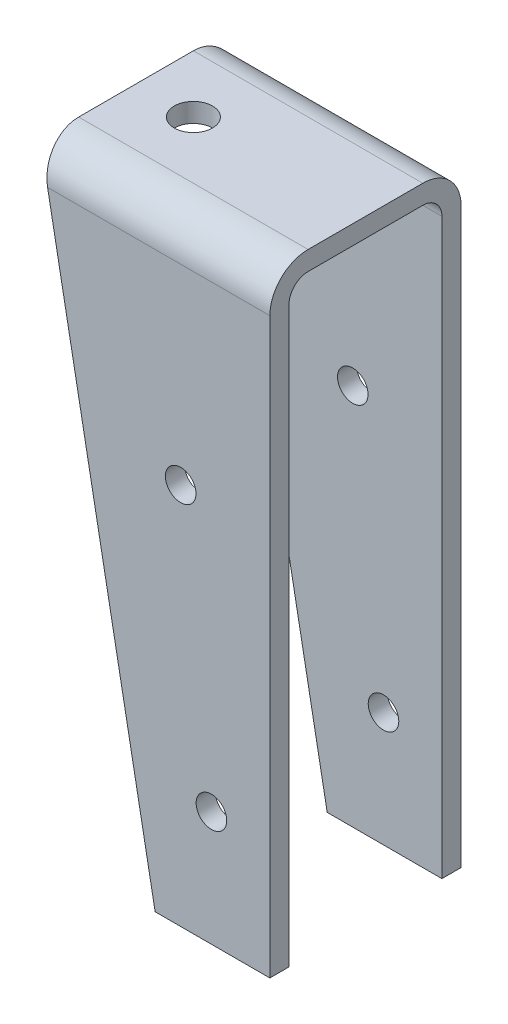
ISO-10303-21;
HEADER;
FILE_DESCRIPTION(('STEP AP214'),'2;1');
FILE_NAME('part.step','',(''),(''),'','','');
FILE_SCHEMA(('AUTOMOTIVE_DESIGN { 1 0 10303 214 1 1 1 1 }'));
ENDSEC;
DATA;
#1=APPLICATION_CONTEXT('core data for automotive mechanical design processes');
#2=APPLICATION_PROTOCOL_DEFINITION('international standard','automotive_design',2000,#1);
#3=PRODUCT_CONTEXT('',#1,'mechanical');
#4=PRODUCT('Part','Part','',(#3));
#5=PRODUCT_RELATED_PRODUCT_CATEGORY('part','',(#4));
#6=PRODUCT_DEFINITION_FORMATION('','',#4);
#7=PRODUCT_DEFINITION_CONTEXT('part definition',#1,'design');
#8=PRODUCT_DEFINITION('design','',#6,#7);
#9=PRODUCT_DEFINITION_SHAPE('','',#8);
#10=(LENGTH_UNIT() NAMED_UNIT(*) SI_UNIT(.MILLI.,.METRE.));
#11=(NAMED_UNIT(*) PLANE_ANGLE_UNIT() SI_UNIT($,.RADIAN.));
#12=(NAMED_UNIT(*) SI_UNIT($,.STERADIAN.) SOLID_ANGLE_UNIT());
#13=UNCERTAINTY_MEASURE_WITH_UNIT(LENGTH_MEASURE(1.E-05),#10,'distance_accuracy_value','');
#14=(GEOMETRIC_REPRESENTATION_CONTEXT(3) GLOBAL_UNCERTAINTY_ASSIGNED_CONTEXT((#13)) GLOBAL_UNIT_ASSIGNED_CONTEXT((#10,
#11,#12)) REPRESENTATION_CONTEXT('',''));
#15=CARTESIAN_POINT('',(0.,0.,0.));
#16=DIRECTION('',(0.,0.,1.));
#17=DIRECTION('',(1.,0.,0.));
#18=AXIS2_PLACEMENT_3D('',#15,#16,#17);
#19=CARTESIAN_POINT('',(-30.,0.,50.));
#20=DIRECTION('',(0.,1.,0.));
#21=DIRECTION('',(0.,0.,1.));
#22=AXIS2_PLACEMENT_3D('',#19,#20,#21);
#23=PLANE('',#22);
#24=DIRECTION('',(0.,0.,-1.));
#25=VECTOR('',#24,1.);
#26=CARTESIAN_POINT('',(0.,0.,50.));
#27=LINE('',#26,#25);
#28=CARTESIAN_POINT('',(0.,0.,5.));
#29=VERTEX_POINT('',#28);
#30=CARTESIAN_POINT('',(0.,0.,0.));
#31=VERTEX_POINT('',#30);
#32=EDGE_CURVE('E144',#29,#31,#27,.T.);
#33=ORIENTED_EDGE('',*,*,#32,.F.);
#34=DIRECTION('',(1.,0.,0.));
#35=VECTOR('',#34,1.);
#36=CARTESIAN_POINT('',(-60.,0.,5.));
#37=LINE('',#36,#35);
#38=CARTESIAN_POINT('',(-30.,0.,5.));
#39=VERTEX_POINT('',#38);
#40=EDGE_CURVE('E138',#39,#29,#37,.T.);
#41=ORIENTED_EDGE('',*,*,#40,.F.);
#42=DIRECTION('',(0.,0.,-1.));
#43=VECTOR('',#42,1.);
#44=CARTESIAN_POINT('',(-30.,0.,50.));
#45=LINE('',#44,#43);
#46=CARTESIAN_POINT('',(-30.,0.,0.));
#47=VERTEX_POINT('',#46);
#48=EDGE_CURVE('E220',#39,#47,#45,.T.);
#49=ORIENTED_EDGE('',*,*,#48,.T.);
#50=DIRECTION('',(1.,0.,0.));
#51=VECTOR('',#50,1.);
#52=CARTESIAN_POINT('',(-30.,0.,0.));
#53=LINE('',#52,#51);
#54=EDGE_CURVE('E207',#47,#31,#53,.T.);
#55=ORIENTED_EDGE('',*,*,#54,.T.);
#56=EDGE_LOOP('',(#33,#41,#49,#55));
#57=FACE_BOUND('',#56,.T.);
#58=ADVANCED_FACE('F26',(#57),#23,.F.);
#59=CARTESIAN_POINT('',(-30.,0.,50.));
#60=VERTEX_POINT('',#59);
#61=CARTESIAN_POINT('',(-30.,0.,45.));
#62=VERTEX_POINT('',#61);
#63=EDGE_CURVE('E137',#60,#62,#45,.T.);
#64=ORIENTED_EDGE('',*,*,#63,.T.);
#65=DIRECTION('',(1.,0.,0.));
#66=VECTOR('',#65,1.);
#67=CARTESIAN_POINT('',(-60.,0.,45.));
#68=LINE('',#67,#66);
#69=CARTESIAN_POINT('',(0.,0.,45.));
#70=VERTEX_POINT('',#69);
#71=EDGE_CURVE('E125',#62,#70,#68,.T.);
#72=ORIENTED_EDGE('',*,*,#71,.T.);
#73=CARTESIAN_POINT('',(0.,0.,50.));
#74=VERTEX_POINT('',#73);
#75=EDGE_CURVE('E135',#74,#70,#27,.T.);
#76=ORIENTED_EDGE('',*,*,#75,.F.);
#77=DIRECTION('',(1.,0.,0.));
#78=VECTOR('',#77,1.);
#79=CARTESIAN_POINT('',(-30.,0.,50.));
#80=LINE('',#79,#78);
#81=EDGE_CURVE('E215',#60,#74,#80,.T.);
#82=ORIENTED_EDGE('',*,*,#81,.F.);
#83=EDGE_LOOP('',(#64,#72,#76,#82));
#84=FACE_BOUND('',#83,.T.);
#85=ADVANCED_FACE('F28',(#84),#23,.F.);
#86=CARTESIAN_POINT('',(0.,0.,50.));
#87=DIRECTION('',(-1.,0.,0.));
#88=DIRECTION('',(0.,0.,1.));
#89=AXIS2_PLACEMENT_3D('',#86,#87,#88);
#90=PLANE('',#89);
#91=DIRECTION('',(0.,1.,0.));
#92=VECTOR('',#91,1.);
#93=CARTESIAN_POINT('',(0.,0.,0.));
#94=LINE('',#93,#92);
#95=CARTESIAN_POINT('',(0.,150.,0.));
#96=VERTEX_POINT('',#95);
#97=EDGE_CURVE('E211',#31,#96,#94,.T.);
#98=ORIENTED_EDGE('',*,*,#97,.T.);
#99=CARTESIAN_POINT('',(0.,150.,10.));
#100=DIRECTION('',(-1.,0.,0.));
#101=DIRECTION('',(0.,0.,1.));
#102=AXIS2_PLACEMENT_3D('',#99,#100,#101);
#103=CIRCLE('',#102,10.);
#104=CARTESIAN_POINT('',(0.,160.,10.));
#105=VERTEX_POINT('',#104);
#106=EDGE_CURVE('E35',#96,#105,#103,.F.);
#107=ORIENTED_EDGE('',*,*,#106,.T.);
#108=DIRECTION('',(0.,0.,-1.));
#109=VECTOR('',#108,1.);
#110=CARTESIAN_POINT('',(0.,160.,50.));
#111=LINE('',#110,#109);
#112=CARTESIAN_POINT('',(0.,160.,40.));
#113=VERTEX_POINT('',#112);
#114=EDGE_CURVE('E149',#113,#105,#111,.T.);
#115=ORIENTED_EDGE('',*,*,#114,.F.);
#116=CARTESIAN_POINT('',(0.,150.,40.));
#117=DIRECTION('',(-1.,0.,0.));
#118=DIRECTION('',(0.,0.,1.));
#119=AXIS2_PLACEMENT_3D('',#116,#117,#118);
#120=CIRCLE('',#119,10.);
#121=CARTESIAN_POINT('',(0.,150.,50.));
#122=VERTEX_POINT('',#121);
#123=EDGE_CURVE('E43',#113,#122,#120,.F.);
#124=ORIENTED_EDGE('',*,*,#123,.T.);
#125=DIRECTION('',(0.,1.,0.));
#126=VECTOR('',#125,1.);
#127=CARTESIAN_POINT('',(0.,0.,50.));
#128=LINE('',#127,#126);
#129=EDGE_CURVE('E141',#74,#122,#128,.T.);
#130=ORIENTED_EDGE('',*,*,#129,.F.);
#131=ORIENTED_EDGE('',*,*,#75,.T.);
#132=DIRECTION('',(0.,-1.,0.));
#133=VECTOR('',#132,1.);
#134=CARTESIAN_POINT('',(0.,0.,45.));
#135=LINE('',#134,#133);
#136=CARTESIAN_POINT('',(0.,150.,45.));
#137=VERTEX_POINT('',#136);
#138=EDGE_CURVE('E121',#137,#70,#135,.T.);
#139=ORIENTED_EDGE('',*,*,#138,.F.);
#140=CARTESIAN_POINT('',(0.,150.,40.));
#141=DIRECTION('',(-1.,0.,0.));
#142=DIRECTION('',(0.,0.,1.));
#143=AXIS2_PLACEMENT_3D('',#140,#141,#142);
#144=CIRCLE('',#143,5.);
#145=CARTESIAN_POINT('',(0.,155.,40.));
#146=VERTEX_POINT('',#145);
#147=EDGE_CURVE('E169',#137,#146,#144,.T.);
#148=ORIENTED_EDGE('',*,*,#147,.T.);
#149=DIRECTION('',(0.,0.,1.));
#150=VECTOR('',#149,1.);
#151=CARTESIAN_POINT('',(0.,155.,5.));
#152=LINE('',#151,#150);
#153=CARTESIAN_POINT('',(0.,155.,10.));
#154=VERTEX_POINT('',#153);
#155=EDGE_CURVE('E130',#154,#146,#152,.T.);
#156=ORIENTED_EDGE('',*,*,#155,.F.);
#157=CARTESIAN_POINT('',(0.,150.,10.));
#158=DIRECTION('',(-1.,0.,0.));
#159=DIRECTION('',(0.,0.,1.));
#160=AXIS2_PLACEMENT_3D('',#157,#158,#159);
#161=CIRCLE('',#160,5.);
#162=CARTESIAN_POINT('',(0.,150.,5.));
#163=VERTEX_POINT('',#162);
#164=EDGE_CURVE('E165',#154,#163,#161,.T.);
#165=ORIENTED_EDGE('',*,*,#164,.T.);
#166=DIRECTION('',(0.,1.,0.));
#167=VECTOR('',#166,1.);
#168=CARTESIAN_POINT('',(0.,0.,5.));
#169=LINE('',#168,#167);
#170=EDGE_CURVE('E191',#29,#163,#169,.T.);
#171=ORIENTED_EDGE('',*,*,#170,.F.);
#172=ORIENTED_EDGE('',*,*,#32,.T.);
#173=EDGE_LOOP('',(#98,#107,#115,#124,#130,#131,#139,#148,#156,#165,#171,#172));
#174=FACE_BOUND('',#173,.T.);
#175=ADVANCED_FACE('F140',(#174),#90,.F.);
#176=CARTESIAN_POINT('',(0.,160.,50.));
#177=DIRECTION('',(0.,-1.,0.));
#178=DIRECTION('',(0.,0.,-1.));
#179=AXIS2_PLACEMENT_3D('',#176,#177,#178);
#180=PLANE('',#179);
#181=CARTESIAN_POINT('',(-45.,160.,25.));
#182=DIRECTION('',(0.,1.,0.));
#183=DIRECTION('',(0.,0.,1.));
#184=AXIS2_PLACEMENT_3D('',#181,#182,#183);
#185=CIRCLE('',#184,4.99999999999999);
#186=CARTESIAN_POINT('',(-45.,160.,30.));
#187=VERTEX_POINT('',#186);
#188=EDGE_CURVE('E390',#187,#187,#185,.T.);
#189=ORIENTED_EDGE('',*,*,#188,.F.);
#190=EDGE_LOOP('',(#189));
#191=FACE_BOUND('',#190,.T.);
#192=ORIENTED_EDGE('',*,*,#114,.T.);
#193=DIRECTION('',(-1.,0.,0.));
#194=VECTOR('',#193,1.);
#195=CARTESIAN_POINT('',(0.,160.,10.));
#196=LINE('',#195,#194);
#197=CARTESIAN_POINT('',(-60.,160.,10.));
#198=VERTEX_POINT('',#197);
#199=EDGE_CURVE('E175',#105,#198,#196,.T.);
#200=ORIENTED_EDGE('',*,*,#199,.T.);
#201=DIRECTION('',(0.,0.,-1.));
#202=VECTOR('',#201,1.);
#203=CARTESIAN_POINT('',(-60.,160.,50.));
#204=LINE('',#203,#202);
#205=CARTESIAN_POINT('',(-60.,160.,40.));
#206=VERTEX_POINT('',#205);
#207=EDGE_CURVE('E221',#206,#198,#204,.T.);
#208=ORIENTED_EDGE('',*,*,#207,.F.);
#209=DIRECTION('',(-1.,0.,0.));
#210=VECTOR('',#209,1.);
#211=CARTESIAN_POINT('',(0.,160.,40.));
#212=LINE('',#211,#210);
#213=EDGE_CURVE('E173',#206,#113,#212,.F.);
#214=ORIENTED_EDGE('',*,*,#213,.T.);
#215=EDGE_LOOP('',(#192,#200,#208,#214));
#216=FACE_BOUND('',#215,.T.);
#217=ADVANCED_FACE('F228',(#191,#216),#180,.F.);
#218=CARTESIAN_POINT('',(-60.,160.,50.));
#219=DIRECTION('',(0.982872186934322,0.184288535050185,0.));
#220=DIRECTION('',(-0.184288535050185,0.982872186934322,0.));
#221=AXIS2_PLACEMENT_3D('',#218,#219,#220);
#222=PLANE('',#221);
#223=ORIENTED_EDGE('',*,*,#207,.T.);
#224=CARTESIAN_POINT('',(-58.125,150.,10.));
#225=DIRECTION('',(0.982872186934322,0.184288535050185,0.));
#226=DIRECTION('',(-0.184288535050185,0.982872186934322,0.));
#227=AXIS2_PLACEMENT_3D('',#224,#225,#226);
#228=ELLIPSE('',#227,10.1742628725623,10.);
#229=CARTESIAN_POINT('',(-58.125,150.,0.));
#230=VERTEX_POINT('',#229);
#231=EDGE_CURVE('E180',#198,#230,#228,.F.);
#232=ORIENTED_EDGE('',*,*,#231,.T.);
#233=DIRECTION('',(0.184288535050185,-0.982872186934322,0.));
#234=VECTOR('',#233,1.);
#235=CARTESIAN_POINT('',(-60.,160.,0.));
#236=LINE('',#235,#234);
#237=EDGE_CURVE('E213',#230,#47,#236,.T.);
#238=ORIENTED_EDGE('',*,*,#237,.T.);
#239=ORIENTED_EDGE('',*,*,#48,.F.);
#240=DIRECTION('',(-0.184288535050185,0.982872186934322,0.));
#241=VECTOR('',#240,1.);
#242=CARTESIAN_POINT('',(-60.,160.,5.));
#243=LINE('',#242,#241);
#244=CARTESIAN_POINT('',(-58.125,150.,5.));
#245=VERTEX_POINT('',#244);
#246=EDGE_CURVE('E154',#39,#245,#243,.T.);
#247=ORIENTED_EDGE('',*,*,#246,.T.);
#248=CARTESIAN_POINT('',(-58.125,150.,10.));
#249=DIRECTION('',(0.982872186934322,0.184288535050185,0.));
#250=DIRECTION('',(-0.184288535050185,0.982872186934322,0.));
#251=AXIS2_PLACEMENT_3D('',#248,#249,#250);
#252=ELLIPSE('',#251,5.08713143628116,5.);
#253=CARTESIAN_POINT('',(-59.0625,155.,10.));
#254=VERTEX_POINT('',#253);
#255=EDGE_CURVE('E167',#245,#254,#252,.T.);
#256=ORIENTED_EDGE('',*,*,#255,.T.);
#257=DIRECTION('',(0.,0.,1.));
#258=VECTOR('',#257,1.);
#259=CARTESIAN_POINT('',(-59.0625,155.,50.));
#260=LINE('',#259,#258);
#261=CARTESIAN_POINT('',(-59.0625,155.,40.));
#262=VERTEX_POINT('',#261);
#263=EDGE_CURVE('E143',#254,#262,#260,.T.);
#264=ORIENTED_EDGE('',*,*,#263,.T.);
#265=CARTESIAN_POINT('',(-58.125,150.,40.));
#266=DIRECTION('',(0.982872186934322,0.184288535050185,0.));
#267=DIRECTION('',(-0.184288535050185,0.982872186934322,0.));
#268=AXIS2_PLACEMENT_3D('',#265,#266,#267);
#269=ELLIPSE('',#268,5.08713143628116,5.);
#270=CARTESIAN_POINT('',(-58.125,150.,45.));
#271=VERTEX_POINT('',#270);
#272=EDGE_CURVE('E171',#262,#271,#269,.T.);
#273=ORIENTED_EDGE('',*,*,#272,.T.);
#274=DIRECTION('',(0.184288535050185,-0.982872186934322,0.));
#275=VECTOR('',#274,1.);
#276=CARTESIAN_POINT('',(-60.,160.,45.));
#277=LINE('',#276,#275);
#278=EDGE_CURVE('E147',#271,#62,#277,.T.);
#279=ORIENTED_EDGE('',*,*,#278,.T.);
#280=ORIENTED_EDGE('',*,*,#63,.F.);
#281=DIRECTION('',(0.184288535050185,-0.982872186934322,0.));
#282=VECTOR('',#281,1.);
#283=CARTESIAN_POINT('',(-60.,160.,50.));
#284=LINE('',#283,#282);
#285=CARTESIAN_POINT('',(-58.125,150.,50.));
#286=VERTEX_POINT('',#285);
#287=EDGE_CURVE('E218',#286,#60,#284,.T.);
#288=ORIENTED_EDGE('',*,*,#287,.F.);
#289=CARTESIAN_POINT('',(-58.125,150.,40.));
#290=DIRECTION('',(0.982872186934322,0.184288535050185,0.));
#291=DIRECTION('',(0.184288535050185,-0.982872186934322,0.));
#292=AXIS2_PLACEMENT_3D('',#289,#290,#291);
#293=ELLIPSE('',#292,10.1742628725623,10.);
#294=EDGE_CURVE('E178',#286,#206,#293,.F.);
#295=ORIENTED_EDGE('',*,*,#294,.T.);
#296=EDGE_LOOP('',(#223,#232,#238,#239,#247,#256,#264,#273,#279,#280,#288,#295));
#297=FACE_BOUND('',#296,.T.);
#298=ADVANCED_FACE('F233',(#297),#222,.F.);
#299=CARTESIAN_POINT('',(0.,0.,50.));
#300=DIRECTION('',(0.,0.,1.));
#301=DIRECTION('',(1.,0.,0.));
#302=AXIS2_PLACEMENT_3D('',#299,#300,#301);
#303=PLANE('',#302);
#304=CARTESIAN_POINT('',(-15.2764742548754,30.,50.));
#305=DIRECTION('',(0.,0.,1.));
#306=DIRECTION('',(1.,0.,0.));
#307=AXIS2_PLACEMENT_3D('',#304,#305,#306);
#308=CIRCLE('',#307,4.);
#309=CARTESIAN_POINT('',(-11.2764742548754,30.,50.));
#310=VERTEX_POINT('',#309);
#311=EDGE_CURVE('E394',#310,#310,#308,.T.);
#312=ORIENTED_EDGE('',*,*,#311,.F.);
#313=EDGE_LOOP('',(#312));
#314=FACE_BOUND('',#313,.T.);
#315=CARTESIAN_POINT('',(-23.3143428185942,100.,50.));
#316=DIRECTION('',(0.,0.,1.));
#317=DIRECTION('',(1.,0.,0.));
#318=AXIS2_PLACEMENT_3D('',#315,#316,#317);
#319=CIRCLE('',#318,4.00000000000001);
#320=CARTESIAN_POINT('',(-19.3143428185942,100.,50.));
#321=VERTEX_POINT('',#320);
#322=EDGE_CURVE('E194',#321,#321,#319,.T.);
#323=ORIENTED_EDGE('',*,*,#322,.F.);
#324=EDGE_LOOP('',(#323));
#325=FACE_BOUND('',#324,.T.);
#326=ORIENTED_EDGE('',*,*,#129,.T.);
#327=DIRECTION('',(-1.,0.,0.));
#328=VECTOR('',#327,1.);
#329=CARTESIAN_POINT('',(-60.,150.,50.));
#330=LINE('',#329,#328);
#331=EDGE_CURVE('E11',#122,#286,#330,.T.);
#332=ORIENTED_EDGE('',*,*,#331,.T.);
#333=ORIENTED_EDGE('',*,*,#287,.T.);
#334=ORIENTED_EDGE('',*,*,#81,.T.);
#335=EDGE_LOOP('',(#326,#332,#333,#334));
#336=FACE_BOUND('',#335,.T.);
#337=ADVANCED_FACE('F258',(#314,#325,#336),#303,.T.);
#338=CARTESIAN_POINT('',(0.,0.,0.));
#339=DIRECTION('',(0.,0.,1.));
#340=DIRECTION('',(1.,0.,0.));
#341=AXIS2_PLACEMENT_3D('',#338,#339,#340);
#342=PLANE('',#341);
#343=CARTESIAN_POINT('',(-15.2764742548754,30.,0.));
#344=DIRECTION('',(0.,0.,1.));
#345=DIRECTION('',(1.,0.,0.));
#346=AXIS2_PLACEMENT_3D('',#343,#344,#345);
#347=CIRCLE('',#346,4.);
#348=CARTESIAN_POINT('',(-11.2764742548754,30.,0.));
#349=VERTEX_POINT('',#348);
#350=EDGE_CURVE('E397',#349,#349,#347,.T.);
#351=ORIENTED_EDGE('',*,*,#350,.T.);
#352=EDGE_LOOP('',(#351));
#353=FACE_BOUND('',#352,.T.);
#354=CARTESIAN_POINT('',(-23.3143428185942,100.,0.));
#355=DIRECTION('',(0.,0.,1.));
#356=DIRECTION('',(1.,0.,0.));
#357=AXIS2_PLACEMENT_3D('',#354,#355,#356);
#358=CIRCLE('',#357,4.00000000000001);
#359=CARTESIAN_POINT('',(-19.3143428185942,100.,0.));
#360=VERTEX_POINT('',#359);
#361=EDGE_CURVE('E187',#360,#360,#358,.T.);
#362=ORIENTED_EDGE('',*,*,#361,.T.);
#363=EDGE_LOOP('',(#362));
#364=FACE_BOUND('',#363,.T.);
#365=ORIENTED_EDGE('',*,*,#237,.F.);
#366=DIRECTION('',(-1.,0.,0.));
#367=VECTOR('',#366,1.);
#368=CARTESIAN_POINT('',(0.,150.,0.));
#369=LINE('',#368,#367);
#370=EDGE_CURVE('E51',#230,#96,#369,.F.);
#371=ORIENTED_EDGE('',*,*,#370,.T.);
#372=ORIENTED_EDGE('',*,*,#97,.F.);
#373=ORIENTED_EDGE('',*,*,#54,.F.);
#374=EDGE_LOOP('',(#365,#371,#372,#373));
#375=FACE_BOUND('',#374,.T.);
#376=ADVANCED_FACE('F237',(#353,#364,#375),#342,.F.);
#377=CARTESIAN_POINT('',(-60.,0.,5.));
#378=DIRECTION('',(0.,0.,-1.));
#379=DIRECTION('',(0.,1.,0.));
#380=AXIS2_PLACEMENT_3D('',#377,#378,#379);
#381=PLANE('',#380);
#382=CARTESIAN_POINT('',(-15.2764742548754,30.,5.));
#383=DIRECTION('',(0.,0.,-1.));
#384=DIRECTION('',(0.,1.,0.));
#385=AXIS2_PLACEMENT_3D('',#382,#383,#384);
#386=CIRCLE('',#385,4.);
#387=CARTESIAN_POINT('',(-15.2764742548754,34.,5.));
#388=VERTEX_POINT('',#387);
#389=EDGE_CURVE('E199',#388,#388,#386,.T.);
#390=ORIENTED_EDGE('',*,*,#389,.T.);
#391=EDGE_LOOP('',(#390));
#392=FACE_BOUND('',#391,.T.);
#393=CARTESIAN_POINT('',(-23.3143428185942,100.,5.));
#394=DIRECTION('',(0.,0.,-1.));
#395=DIRECTION('',(0.,1.,0.));
#396=AXIS2_PLACEMENT_3D('',#393,#394,#395);
#397=CIRCLE('',#396,4.00000000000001);
#398=CARTESIAN_POINT('',(-23.3143428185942,104.,5.));
#399=VERTEX_POINT('',#398);
#400=EDGE_CURVE('E186',#399,#399,#397,.T.);
#401=ORIENTED_EDGE('',*,*,#400,.T.);
#402=EDGE_LOOP('',(#401));
#403=FACE_BOUND('',#402,.T.);
#404=ORIENTED_EDGE('',*,*,#170,.T.);
#405=DIRECTION('',(1.,0.,0.));
#406=VECTOR('',#405,1.);
#407=CARTESIAN_POINT('',(-59.0625,150.,5.));
#408=LINE('',#407,#406);
#409=EDGE_CURVE('E162',#163,#245,#408,.F.);
#410=ORIENTED_EDGE('',*,*,#409,.T.);
#411=ORIENTED_EDGE('',*,*,#246,.F.);
#412=ORIENTED_EDGE('',*,*,#40,.T.);
#413=EDGE_LOOP('',(#404,#410,#411,#412));
#414=FACE_BOUND('',#413,.T.);
#415=ADVANCED_FACE('F295',(#392,#403,#414),#381,.F.);
#416=CARTESIAN_POINT('',(-60.,0.,45.));
#417=DIRECTION('',(0.,0.,1.));
#418=DIRECTION('',(1.,0.,0.));
#419=AXIS2_PLACEMENT_3D('',#416,#417,#418);
#420=PLANE('',#419);
#421=CARTESIAN_POINT('',(-15.2764742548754,30.,45.));
#422=DIRECTION('',(0.,0.,1.));
#423=DIRECTION('',(1.,0.,0.));
#424=AXIS2_PLACEMENT_3D('',#421,#422,#423);
#425=CIRCLE('',#424,4.);
#426=CARTESIAN_POINT('',(-11.2764742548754,30.,45.));
#427=VERTEX_POINT('',#426);
#428=EDGE_CURVE('E30',#427,#427,#425,.T.);
#429=ORIENTED_EDGE('',*,*,#428,.T.);
#430=EDGE_LOOP('',(#429));
#431=FACE_BOUND('',#430,.T.);
#432=CARTESIAN_POINT('',(-23.3143428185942,100.,45.));
#433=DIRECTION('',(0.,0.,1.));
#434=DIRECTION('',(1.,0.,0.));
#435=AXIS2_PLACEMENT_3D('',#432,#433,#434);
#436=CIRCLE('',#435,4.00000000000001);
#437=CARTESIAN_POINT('',(-19.3143428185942,100.,45.));
#438=VERTEX_POINT('',#437);
#439=EDGE_CURVE('E184',#438,#438,#436,.T.);
#440=ORIENTED_EDGE('',*,*,#439,.T.);
#441=EDGE_LOOP('',(#440));
#442=FACE_BOUND('',#441,.T.);
#443=ORIENTED_EDGE('',*,*,#278,.F.);
#444=DIRECTION('',(1.,0.,0.));
#445=VECTOR('',#444,1.);
#446=CARTESIAN_POINT('',(0.,150.,45.));
#447=LINE('',#446,#445);
#448=EDGE_CURVE('E128',#271,#137,#447,.T.);
#449=ORIENTED_EDGE('',*,*,#448,.T.);
#450=ORIENTED_EDGE('',*,*,#138,.T.);
#451=ORIENTED_EDGE('',*,*,#71,.F.);
#452=EDGE_LOOP('',(#443,#449,#450,#451));
#453=FACE_BOUND('',#452,.T.);
#454=ADVANCED_FACE('F124',(#431,#442,#453),#420,.F.);
#455=CARTESIAN_POINT('',(-60.,155.,5.));
#456=DIRECTION('',(0.,1.,0.));
#457=DIRECTION('',(0.,0.,1.));
#458=AXIS2_PLACEMENT_3D('',#455,#456,#457);
#459=PLANE('',#458);
#460=CARTESIAN_POINT('',(-45.,155.,25.));
#461=DIRECTION('',(0.,1.,0.));
#462=DIRECTION('',(0.,0.,1.));
#463=AXIS2_PLACEMENT_3D('',#460,#461,#462);
#464=CIRCLE('',#463,4.99999999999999);
#465=CARTESIAN_POINT('',(-45.,155.,30.));
#466=VERTEX_POINT('',#465);
#467=EDGE_CURVE('E393',#466,#466,#464,.T.);
#468=ORIENTED_EDGE('',*,*,#467,.T.);
#469=EDGE_LOOP('',(#468));
#470=FACE_BOUND('',#469,.T.);
#471=ORIENTED_EDGE('',*,*,#263,.F.);
#472=DIRECTION('',(1.,0.,0.));
#473=VECTOR('',#472,1.);
#474=CARTESIAN_POINT('',(0.,155.,10.));
#475=LINE('',#474,#473);
#476=EDGE_CURVE('E159',#254,#154,#475,.T.);
#477=ORIENTED_EDGE('',*,*,#476,.T.);
#478=ORIENTED_EDGE('',*,*,#155,.T.);
#479=DIRECTION('',(1.,0.,0.));
#480=VECTOR('',#479,1.);
#481=CARTESIAN_POINT('',(-59.0625,155.,40.));
#482=LINE('',#481,#480);
#483=EDGE_CURVE('E157',#146,#262,#482,.F.);
#484=ORIENTED_EDGE('',*,*,#483,.T.);
#485=EDGE_LOOP('',(#471,#477,#478,#484));
#486=FACE_BOUND('',#485,.T.);
#487=ADVANCED_FACE('F250',(#470,#486),#459,.F.);
#488=CARTESIAN_POINT('',(-60.,150.,10.));
#489=DIRECTION('',(-1.,0.,0.));
#490=DIRECTION('',(0.,0.,1.));
#491=AXIS2_PLACEMENT_3D('',#488,#489,#490);
#492=CYLINDRICAL_SURFACE('',#491,5.);
#493=ORIENTED_EDGE('',*,*,#255,.F.);
#494=ORIENTED_EDGE('',*,*,#409,.F.);
#495=ORIENTED_EDGE('',*,*,#164,.F.);
#496=ORIENTED_EDGE('',*,*,#476,.F.);
#497=EDGE_LOOP('',(#493,#494,#495,#496));
#498=FACE_BOUND('',#497,.T.);
#499=ADVANCED_FACE('F247',(#498),#492,.F.);
#500=CARTESIAN_POINT('',(-60.,150.,40.));
#501=DIRECTION('',(-1.,0.,0.));
#502=DIRECTION('',(0.,0.,1.));
#503=AXIS2_PLACEMENT_3D('',#500,#501,#502);
#504=CYLINDRICAL_SURFACE('',#503,5.);
#505=ORIENTED_EDGE('',*,*,#272,.F.);
#506=ORIENTED_EDGE('',*,*,#483,.F.);
#507=ORIENTED_EDGE('',*,*,#147,.F.);
#508=ORIENTED_EDGE('',*,*,#448,.F.);
#509=EDGE_LOOP('',(#505,#506,#507,#508));
#510=FACE_BOUND('',#509,.T.);
#511=ADVANCED_FACE('F255',(#510),#504,.F.);
#512=CARTESIAN_POINT('',(0.,150.,10.));
#513=DIRECTION('',(-1.,0.,0.));
#514=DIRECTION('',(0.,0.,1.));
#515=AXIS2_PLACEMENT_3D('',#512,#513,#514);
#516=CYLINDRICAL_SURFACE('',#515,10.);
#517=ORIENTED_EDGE('',*,*,#106,.F.);
#518=ORIENTED_EDGE('',*,*,#370,.F.);
#519=ORIENTED_EDGE('',*,*,#231,.F.);
#520=ORIENTED_EDGE('',*,*,#199,.F.);
#521=EDGE_LOOP('',(#517,#518,#519,#520));
#522=FACE_BOUND('',#521,.T.);
#523=ADVANCED_FACE('F232',(#522),#516,.T.);
#524=CARTESIAN_POINT('',(0.,150.,40.));
#525=DIRECTION('',(1.,0.,0.));
#526=DIRECTION('',(0.,0.,-1.));
#527=AXIS2_PLACEMENT_3D('',#524,#525,#526);
#528=CYLINDRICAL_SURFACE('',#527,10.);
#529=ORIENTED_EDGE('',*,*,#123,.F.);
#530=ORIENTED_EDGE('',*,*,#213,.F.);
#531=ORIENTED_EDGE('',*,*,#294,.F.);
#532=ORIENTED_EDGE('',*,*,#331,.F.);
#533=EDGE_LOOP('',(#529,#530,#531,#532));
#534=FACE_BOUND('',#533,.T.);
#535=ADVANCED_FACE('F261',(#534),#528,.T.);
#536=CARTESIAN_POINT('',(-23.3143428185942,100.,0.));
#537=DIRECTION('',(0.,0.,1.));
#538=DIRECTION('',(1.,0.,0.));
#539=AXIS2_PLACEMENT_3D('',#536,#537,#538);
#540=CYLINDRICAL_SURFACE('',#539,4.00000000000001);
#541=ORIENTED_EDGE('',*,*,#322,.T.);
#542=EDGE_LOOP('',(#541));
#543=FACE_BOUND('',#542,.T.);
#544=ORIENTED_EDGE('',*,*,#439,.F.);
#545=EDGE_LOOP('',(#544));
#546=FACE_BOUND('',#545,.T.);
#547=ADVANCED_FACE('F263',(#543,#546),#540,.F.);
#548=ORIENTED_EDGE('',*,*,#361,.F.);
#549=EDGE_LOOP('',(#548));
#550=FACE_BOUND('',#549,.T.);
#551=ORIENTED_EDGE('',*,*,#400,.F.);
#552=EDGE_LOOP('',(#551));
#553=FACE_BOUND('',#552,.T.);
#554=ADVANCED_FACE('F270',(#550,#553),#540,.F.);
#555=CARTESIAN_POINT('',(-15.2764742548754,30.,0.));
#556=DIRECTION('',(0.,0.,1.));
#557=DIRECTION('',(1.,0.,0.));
#558=AXIS2_PLACEMENT_3D('',#555,#556,#557);
#559=CYLINDRICAL_SURFACE('',#558,4.);
#560=ORIENTED_EDGE('',*,*,#311,.T.);
#561=EDGE_LOOP('',(#560));
#562=FACE_BOUND('',#561,.T.);
#563=ORIENTED_EDGE('',*,*,#428,.F.);
#564=EDGE_LOOP('',(#563));
#565=FACE_BOUND('',#564,.T.);
#566=ADVANCED_FACE('F357',(#562,#565),#559,.F.);
#567=ORIENTED_EDGE('',*,*,#350,.F.);
#568=EDGE_LOOP('',(#567));
#569=FACE_BOUND('',#568,.T.);
#570=ORIENTED_EDGE('',*,*,#389,.F.);
#571=EDGE_LOOP('',(#570));
#572=FACE_BOUND('',#571,.T.);
#573=ADVANCED_FACE('F352',(#569,#572),#559,.F.);
#574=CARTESIAN_POINT('',(-45.,160.,25.));
#575=DIRECTION('',(0.,1.,0.));
#576=DIRECTION('',(0.,0.,1.));
#577=AXIS2_PLACEMENT_3D('',#574,#575,#576);
#578=CYLINDRICAL_SURFACE('',#577,4.99999999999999);
#579=ORIENTED_EDGE('',*,*,#188,.T.);
#580=EDGE_LOOP('',(#579));
#581=FACE_BOUND('',#580,.T.);
#582=ORIENTED_EDGE('',*,*,#467,.F.);
#583=EDGE_LOOP('',(#582));
#584=FACE_BOUND('',#583,.T.);
#585=ADVANCED_FACE('F356',(#581,#584),#578,.F.);
#586=CLOSED_SHELL('',(#58,#85,#175,#217,#298,#337,#376,#415,#454,#487,#499,#511,#523,#535,#547,
#554,#566,#573,#585));
#587=MANIFOLD_SOLID_BREP('B2',#586);
#588=ADVANCED_BREP_SHAPE_REPRESENTATION('',(#18,#587),#14);
#589=SHAPE_DEFINITION_REPRESENTATION(#9,#588);
ENDSEC;
END-ISO-10303-21;
